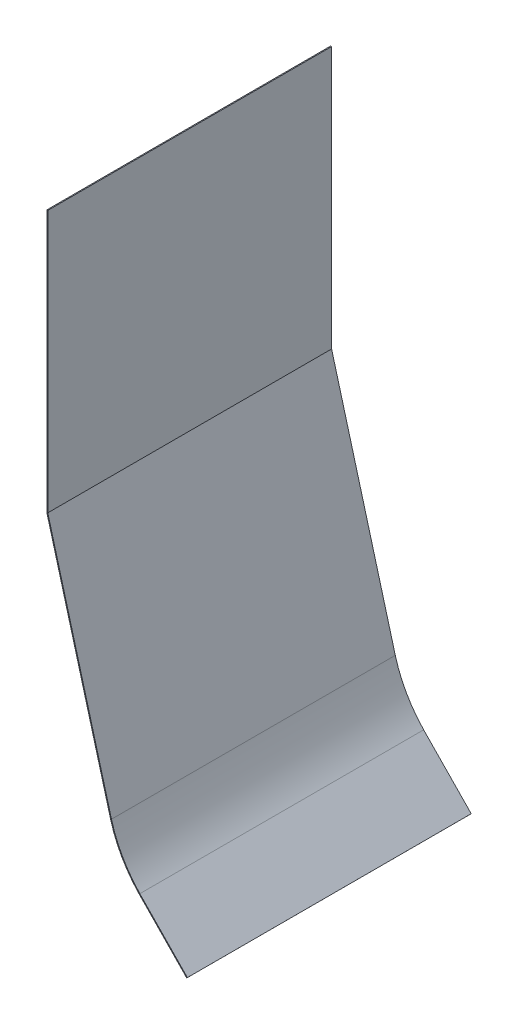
from build123d import *

# Parameters (mm, degrees)
BOSS_EXTRUDE1_DEPTH = 596


with BuildPart() as part:
    # Sketch2 → Boss-Extrude1 (new, symmetric)
    with BuildSketch(Plane.XY):
        with BuildLine():
            Line((-574.201160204, 840.175075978), (-773.946762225, 1045.533410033))
            ThreePointArc((-773.946762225, 1045.533410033), (-846.633047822, 1143.795820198), (-893.083134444, 1256.849731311))
            Line((-893.083134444, 1256.849731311), (-1160.568500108, 2237.386104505))
            Line((-1160.568500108, 2237.386104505), (-1160.568500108, 3337.386104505))
            Line((-1160.568500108, 3337.386104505), (-1164.568500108, 3337.386104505))
            Line((-1164.568500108, 3337.386104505), (-1164.714666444, 2237.386114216))
            Line((-1164.714666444, 2237.386114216), (-896.942123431, 1255.797018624))
            ThreePointArc((-896.942123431, 1255.797018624), (-850.111960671, 1141.821664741), (-776.829596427, 1042.760367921))
            Line((-776.829596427, 1042.760367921), (-577, 837.317367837))
            Line((-577, 837.317367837), (-574.201160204, 840.175075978))
        make_face()
    extrude(amount=BOSS_EXTRUDE1_DEPTH, both=True)


solid = part.part
